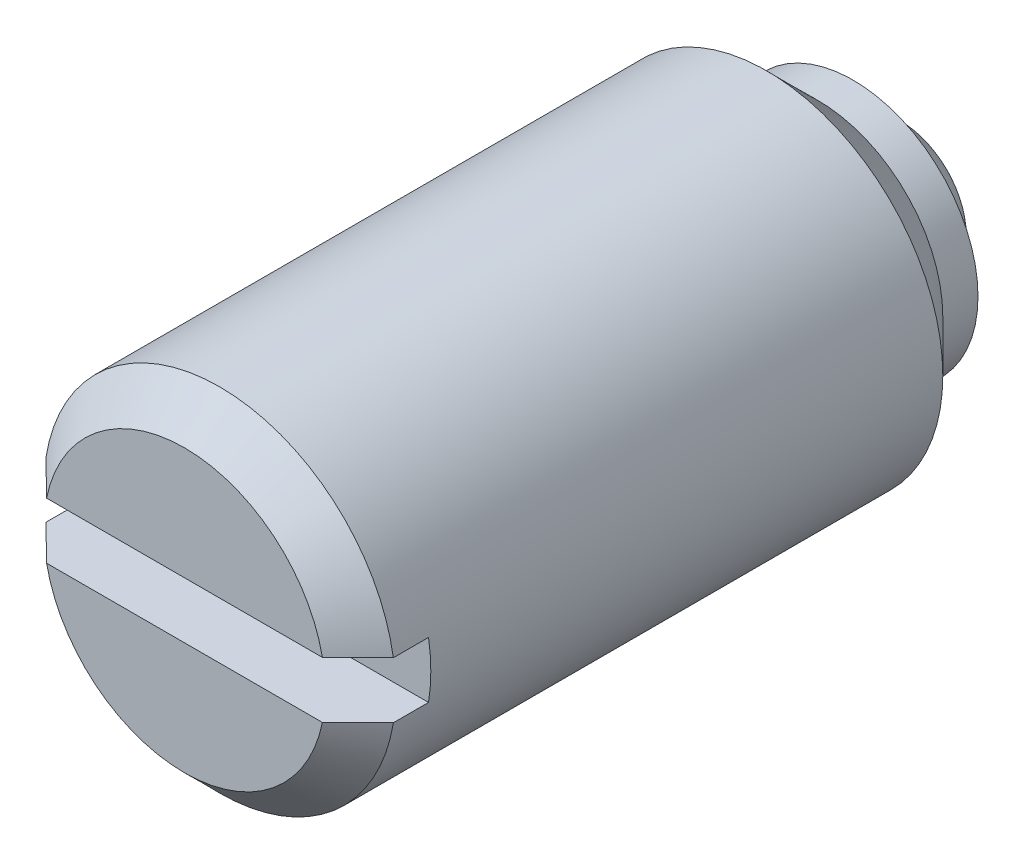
ISO-10303-21;
HEADER;
FILE_DESCRIPTION(('STEP AP214'),'2;1');
FILE_NAME('part.step','',(''),(''),'','','');
FILE_SCHEMA(('AUTOMOTIVE_DESIGN { 1 0 10303 214 1 1 1 1 }'));
ENDSEC;
DATA;
#1=APPLICATION_CONTEXT('core data for automotive mechanical design processes');
#2=APPLICATION_PROTOCOL_DEFINITION('international standard','automotive_design',2000,#1);
#3=PRODUCT_CONTEXT('',#1,'mechanical');
#4=PRODUCT('Part','Part','',(#3));
#5=PRODUCT_RELATED_PRODUCT_CATEGORY('part','',(#4));
#6=PRODUCT_DEFINITION_FORMATION('','',#4);
#7=PRODUCT_DEFINITION_CONTEXT('part definition',#1,'design');
#8=PRODUCT_DEFINITION('design','',#6,#7);
#9=PRODUCT_DEFINITION_SHAPE('','',#8);
#10=(LENGTH_UNIT() NAMED_UNIT(*) SI_UNIT(.MILLI.,.METRE.));
#11=(NAMED_UNIT(*) PLANE_ANGLE_UNIT() SI_UNIT($,.RADIAN.));
#12=(NAMED_UNIT(*) SI_UNIT($,.STERADIAN.) SOLID_ANGLE_UNIT());
#13=UNCERTAINTY_MEASURE_WITH_UNIT(LENGTH_MEASURE(1.E-05),#10,'distance_accuracy_value','');
#14=(GEOMETRIC_REPRESENTATION_CONTEXT(3) GLOBAL_UNCERTAINTY_ASSIGNED_CONTEXT((#13)) GLOBAL_UNIT_ASSIGNED_CONTEXT((#10,
#11,#12)) REPRESENTATION_CONTEXT('',''));
#15=CARTESIAN_POINT('',(0.,0.,0.));
#16=DIRECTION('',(0.,0.,1.));
#17=DIRECTION('',(1.,0.,0.));
#18=AXIS2_PLACEMENT_3D('',#15,#16,#17);
#19=CARTESIAN_POINT('',(0.,0.,1.));
#20=DIRECTION('',(0.,0.,-1.));
#21=DIRECTION('',(-1.,0.,0.));
#22=AXIS2_PLACEMENT_3D('',#19,#20,#21);
#23=CYLINDRICAL_SURFACE('',#22,5.);
#24=DIRECTION('',(0.,0.,1.));
#25=VECTOR('',#24,1.);
#26=CARTESIAN_POINT('',(4.93558507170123,-0.8,19.));
#27=LINE('',#26,#25);
#28=CARTESIAN_POINT('',(4.93558507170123,-0.8,19.));
#29=VERTEX_POINT('',#28);
#30=CARTESIAN_POINT('',(4.93558507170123,-0.8,20.));
#31=VERTEX_POINT('',#30);
#32=EDGE_CURVE('E83',#29,#31,#27,.T.);
#33=ORIENTED_EDGE('',*,*,#32,.T.);
#34=CARTESIAN_POINT('',(0.,0.,20.));
#35=DIRECTION('',(0.,0.,1.));
#36=DIRECTION('',(1.,0.,0.));
#37=AXIS2_PLACEMENT_3D('',#34,#35,#36);
#38=CIRCLE('',#37,5.);
#39=CARTESIAN_POINT('',(-4.93558507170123,-0.8,20.));
#40=VERTEX_POINT('',#39);
#41=EDGE_CURVE('E89',#31,#40,#38,.F.);
#42=ORIENTED_EDGE('',*,*,#41,.T.);
#43=DIRECTION('',(0.,0.,1.));
#44=VECTOR('',#43,1.);
#45=CARTESIAN_POINT('',(-4.93558507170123,-0.8,19.));
#46=LINE('',#45,#44);
#47=CARTESIAN_POINT('',(-4.93558507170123,-0.8,19.));
#48=VERTEX_POINT('',#47);
#49=EDGE_CURVE('E81',#48,#40,#46,.T.);
#50=ORIENTED_EDGE('',*,*,#49,.F.);
#51=CARTESIAN_POINT('',(0.,0.,19.));
#52=DIRECTION('',(0.,0.,1.));
#53=DIRECTION('',(1.,0.,0.));
#54=AXIS2_PLACEMENT_3D('',#51,#52,#53);
#55=CIRCLE('',#54,5.);
#56=CARTESIAN_POINT('',(-4.93558507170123,0.8,19.));
#57=VERTEX_POINT('',#56);
#58=EDGE_CURVE('E65',#57,#48,#55,.T.);
#59=ORIENTED_EDGE('',*,*,#58,.F.);
#60=DIRECTION('',(0.,0.,1.));
#61=VECTOR('',#60,1.);
#62=CARTESIAN_POINT('',(-4.93558507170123,0.8,19.));
#63=LINE('',#62,#61);
#64=CARTESIAN_POINT('',(-4.93558507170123,0.8,20.));
#65=VERTEX_POINT('',#64);
#66=EDGE_CURVE('E96',#57,#65,#63,.T.);
#67=ORIENTED_EDGE('',*,*,#66,.T.);
#68=CARTESIAN_POINT('',(0.,0.,20.));
#69=DIRECTION('',(0.,0.,1.));
#70=DIRECTION('',(1.,0.,0.));
#71=AXIS2_PLACEMENT_3D('',#68,#69,#70);
#72=CIRCLE('',#71,5.);
#73=CARTESIAN_POINT('',(4.93558507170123,0.8,20.));
#74=VERTEX_POINT('',#73);
#75=EDGE_CURVE('E101',#65,#74,#72,.F.);
#76=ORIENTED_EDGE('',*,*,#75,.T.);
#77=DIRECTION('',(0.,0.,1.));
#78=VECTOR('',#77,1.);
#79=CARTESIAN_POINT('',(4.93558507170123,0.8,19.));
#80=LINE('',#79,#78);
#81=CARTESIAN_POINT('',(4.93558507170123,0.8,19.));
#82=VERTEX_POINT('',#81);
#83=EDGE_CURVE('E91',#82,#74,#80,.T.);
#84=ORIENTED_EDGE('',*,*,#83,.F.);
#85=EDGE_CURVE('E77',#29,#82,#55,.T.);
#86=ORIENTED_EDGE('',*,*,#85,.F.);
#87=EDGE_LOOP('',(#33,#42,#50,#59,#67,#76,#84,#86));
#88=FACE_BOUND('',#87,.T.);
#89=CARTESIAN_POINT('',(0.,0.,4.45));
#90=DIRECTION('',(0.,0.,1.));
#91=DIRECTION('',(1.,0.,0.));
#92=AXIS2_PLACEMENT_3D('',#89,#90,#91);
#93=CIRCLE('',#92,5.);
#94=CARTESIAN_POINT('',(5.,0.,4.45));
#95=VERTEX_POINT('',#94);
#96=EDGE_CURVE('E165',#95,#95,#93,.T.);
#97=ORIENTED_EDGE('',*,*,#96,.T.);
#98=EDGE_LOOP('',(#97));
#99=FACE_BOUND('',#98,.T.);
#100=ADVANCED_FACE('F14',(#88,#99),#23,.T.);
#101=CARTESIAN_POINT('',(0.,5.,21.));
#102=DIRECTION('',(0.,0.,1.));
#103=DIRECTION('',(1.,0.,0.));
#104=AXIS2_PLACEMENT_3D('',#101,#102,#103);
#105=PLANE('',#104);
#106=DIRECTION('',(1.,0.,0.));
#107=VECTOR('',#106,1.);
#108=CARTESIAN_POINT('',(-4.93558507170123,0.8,21.));
#109=LINE('',#108,#107);
#110=CARTESIAN_POINT('',(-3.91918358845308,0.8,21.));
#111=VERTEX_POINT('',#110);
#112=CARTESIAN_POINT('',(3.91918358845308,0.8,21.));
#113=VERTEX_POINT('',#112);
#114=EDGE_CURVE('E75',#111,#113,#109,.T.);
#115=ORIENTED_EDGE('',*,*,#114,.T.);
#116=CARTESIAN_POINT('',(0.,0.,21.));
#117=DIRECTION('',(0.,0.,1.));
#118=DIRECTION('',(1.,0.,0.));
#119=AXIS2_PLACEMENT_3D('',#116,#117,#118);
#120=CIRCLE('',#119,4.);
#121=EDGE_CURVE('E9',#113,#111,#120,.T.);
#122=ORIENTED_EDGE('',*,*,#121,.T.);
#123=EDGE_LOOP('',(#115,#122));
#124=FACE_BOUND('',#123,.T.);
#125=ADVANCED_FACE('F182',(#124),#105,.T.);
#126=DIRECTION('',(1.,0.,0.));
#127=VECTOR('',#126,1.);
#128=CARTESIAN_POINT('',(-4.93558507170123,-0.8,21.));
#129=LINE('',#128,#127);
#130=CARTESIAN_POINT('',(-3.91918358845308,-0.8,21.));
#131=VERTEX_POINT('',#130);
#132=CARTESIAN_POINT('',(3.91918358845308,-0.8,21.));
#133=VERTEX_POINT('',#132);
#134=EDGE_CURVE('E152',#131,#133,#129,.T.);
#135=ORIENTED_EDGE('',*,*,#134,.F.);
#136=CARTESIAN_POINT('',(0.,0.,21.));
#137=DIRECTION('',(0.,0.,1.));
#138=DIRECTION('',(1.,0.,0.));
#139=AXIS2_PLACEMENT_3D('',#136,#137,#138);
#140=CIRCLE('',#139,4.);
#141=EDGE_CURVE('E146',#131,#133,#140,.T.);
#142=ORIENTED_EDGE('',*,*,#141,.T.);
#143=EDGE_LOOP('',(#135,#142));
#144=FACE_BOUND('',#143,.T.);
#145=ADVANCED_FACE('F132',(#144),#105,.T.);
#146=CARTESIAN_POINT('',(-4.93558507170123,0.8,19.));
#147=DIRECTION('',(0.,-1.,0.));
#148=DIRECTION('',(1.,0.,0.));
#149=AXIS2_PLACEMENT_3D('',#146,#147,#148);
#150=PLANE('',#149);
#151=ORIENTED_EDGE('',*,*,#83,.T.);
#152=CARTESIAN_POINT('',(4.93558507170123,0.8,20.));
#153=CARTESIAN_POINT('',(4.85102221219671,0.8,20.0834727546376));
#154=CARTESIAN_POINT('',(4.76643256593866,0.799999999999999,20.1669183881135));
#155=CARTESIAN_POINT('',(4.59718901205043,0.799999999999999,20.3337443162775));
#156=CARTESIAN_POINT('',(4.51253510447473,0.799999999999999,20.4171246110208));
#157=CARTESIAN_POINT('',(4.34315217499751,0.799999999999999,20.583808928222));
#158=CARTESIAN_POINT('',(4.25842315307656,0.799999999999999,20.6671129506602));
#159=CARTESIAN_POINT('',(4.08887483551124,0.799999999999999,20.8336292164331));
#160=CARTESIAN_POINT('',(4.00405553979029,0.8,20.9168414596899));
#161=CARTESIAN_POINT('',(3.91918358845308,0.8,21.));
#162=B_SPLINE_CURVE_WITH_KNOTS('',3,(#152,#153,#154,#155,#156,#157,#158,#159,#160,#161),
.UNSPECIFIED.,.F.,.F.,(4,2,2,2,4),(0.,0.356464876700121,0.712929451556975,1.06939411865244,
1.42585908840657),.UNSPECIFIED.);
#163=EDGE_CURVE('E23',#74,#113,#162,.T.);
#164=ORIENTED_EDGE('',*,*,#163,.T.);
#165=ORIENTED_EDGE('',*,*,#114,.F.);
#166=CARTESIAN_POINT('',(-3.91918358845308,0.8,21.));
#167=CARTESIAN_POINT('',(-4.00405553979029,0.8,20.9168414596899));
#168=CARTESIAN_POINT('',(-4.08887483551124,0.8,20.8336292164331));
#169=CARTESIAN_POINT('',(-4.25842315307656,0.8,20.6671129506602));
#170=CARTESIAN_POINT('',(-4.34315217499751,0.8,20.583808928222));
#171=CARTESIAN_POINT('',(-4.51253510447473,0.8,20.4171246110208));
#172=CARTESIAN_POINT('',(-4.59718901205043,0.8,20.3337443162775));
#173=CARTESIAN_POINT('',(-4.76643256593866,0.8,20.1669183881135));
#174=CARTESIAN_POINT('',(-4.85102221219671,0.8,20.0834727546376));
#175=CARTESIAN_POINT('',(-4.93558507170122,0.8,20.));
#176=B_SPLINE_CURVE_WITH_KNOTS('',3,(#166,#167,#168,#169,#170,#171,#172,#173,#174,#175),
.UNSPECIFIED.,.F.,.F.,(4,2,2,2,4),(0.,0.356464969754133,0.71292963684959,1.06939421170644,
1.42585908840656),.UNSPECIFIED.);
#177=EDGE_CURVE('E137',#111,#65,#176,.T.);
#178=ORIENTED_EDGE('',*,*,#177,.T.);
#179=ORIENTED_EDGE('',*,*,#66,.F.);
#180=DIRECTION('',(1.,0.,0.));
#181=VECTOR('',#180,1.);
#182=CARTESIAN_POINT('',(-4.93558507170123,0.8,19.));
#183=LINE('',#182,#181);
#184=EDGE_CURVE('E71',#57,#82,#183,.T.);
#185=ORIENTED_EDGE('',*,*,#184,.T.);
#186=EDGE_LOOP('',(#151,#164,#165,#178,#179,#185));
#187=FACE_BOUND('',#186,.T.);
#188=ADVANCED_FACE('F125',(#187),#150,.T.);
#189=CARTESIAN_POINT('',(-4.93558507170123,-0.8,19.));
#190=DIRECTION('',(0.,-1.,0.));
#191=DIRECTION('',(1.,0.,0.));
#192=AXIS2_PLACEMENT_3D('',#189,#190,#191);
#193=PLANE('',#192);
#194=ORIENTED_EDGE('',*,*,#49,.T.);
#195=CARTESIAN_POINT('',(-4.93558507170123,-0.8,20.));
#196=CARTESIAN_POINT('',(-4.85102221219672,-0.8,20.0834727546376));
#197=CARTESIAN_POINT('',(-4.76643256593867,-0.8,20.1669183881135));
#198=CARTESIAN_POINT('',(-4.59718901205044,-0.8,20.3337443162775));
#199=CARTESIAN_POINT('',(-4.51253510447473,-0.8,20.4171246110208));
#200=CARTESIAN_POINT('',(-4.34315217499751,-0.8,20.583808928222));
#201=CARTESIAN_POINT('',(-4.25842315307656,-0.8,20.6671129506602));
#202=CARTESIAN_POINT('',(-4.08887483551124,-0.8,20.8336292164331));
#203=CARTESIAN_POINT('',(-4.00405553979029,-0.8,20.9168414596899));
#204=CARTESIAN_POINT('',(-3.91918358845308,-0.8,21.));
#205=B_SPLINE_CURVE_WITH_KNOTS('',3,(#195,#196,#197,#198,#199,#200,#201,#202,#203,#204),
.UNSPECIFIED.,.F.,.F.,(4,2,2,2,4),(0.,0.356464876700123,0.712929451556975,1.06939411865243,
1.42585908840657),.UNSPECIFIED.);
#206=EDGE_CURVE('E112',#40,#131,#205,.T.);
#207=ORIENTED_EDGE('',*,*,#206,.T.);
#208=ORIENTED_EDGE('',*,*,#134,.T.);
#209=CARTESIAN_POINT('',(3.91918358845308,-0.8,21.));
#210=CARTESIAN_POINT('',(4.00405553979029,-0.8,20.9168414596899));
#211=CARTESIAN_POINT('',(4.08887483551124,-0.800000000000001,20.8336292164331));
#212=CARTESIAN_POINT('',(4.25842315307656,-0.800000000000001,20.6671129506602));
#213=CARTESIAN_POINT('',(4.34315217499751,-0.800000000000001,20.583808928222));
#214=CARTESIAN_POINT('',(4.51253510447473,-0.800000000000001,20.4171246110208));
#215=CARTESIAN_POINT('',(4.59718901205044,-0.800000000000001,20.3337443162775));
#216=CARTESIAN_POINT('',(4.76643256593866,-0.800000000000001,20.1669183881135));
#217=CARTESIAN_POINT('',(4.85102221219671,-0.8,20.0834727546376));
#218=CARTESIAN_POINT('',(4.93558507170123,-0.8,20.));
#219=B_SPLINE_CURVE_WITH_KNOTS('',3,(#209,#210,#211,#212,#213,#214,#215,#216,#217,#218),
.UNSPECIFIED.,.F.,.F.,(4,2,2,2,4),(0.,0.356464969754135,0.712929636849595,1.06939421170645,
1.42585908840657),.UNSPECIFIED.);
#220=EDGE_CURVE('E105',#133,#31,#219,.T.);
#221=ORIENTED_EDGE('',*,*,#220,.T.);
#222=ORIENTED_EDGE('',*,*,#32,.F.);
#223=DIRECTION('',(1.,0.,0.));
#224=VECTOR('',#223,1.);
#225=CARTESIAN_POINT('',(-4.93558507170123,-0.8,19.));
#226=LINE('',#225,#224);
#227=EDGE_CURVE('E68',#48,#29,#226,.T.);
#228=ORIENTED_EDGE('',*,*,#227,.F.);
#229=EDGE_LOOP('',(#194,#207,#208,#221,#222,#228));
#230=FACE_BOUND('',#229,.T.);
#231=ADVANCED_FACE('F80',(#230),#193,.F.);
#232=CARTESIAN_POINT('',(0.,0.,19.));
#233=DIRECTION('',(0.,0.,1.));
#234=DIRECTION('',(1.,0.,0.));
#235=AXIS2_PLACEMENT_3D('',#232,#233,#234);
#236=PLANE('',#235);
#237=ORIENTED_EDGE('',*,*,#58,.T.);
#238=ORIENTED_EDGE('',*,*,#227,.T.);
#239=ORIENTED_EDGE('',*,*,#85,.T.);
#240=ORIENTED_EDGE('',*,*,#184,.F.);
#241=EDGE_LOOP('',(#237,#238,#239,#240));
#242=FACE_BOUND('',#241,.T.);
#243=ADVANCED_FACE('F67',(#242),#236,.T.);
#244=CARTESIAN_POINT('',(0.,0.,24.0697883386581));
#245=DIRECTION('',(0.,0.,1.));
#246=DIRECTION('',(1.,0.,0.));
#247=AXIS2_PLACEMENT_3D('',#244,#245,#246);
#248=CYLINDRICAL_SURFACE('',#247,3.55);
#249=CARTESIAN_POINT('',(0.,0.,2.));
#250=DIRECTION('',(0.,0.,1.));
#251=DIRECTION('',(1.,0.,0.));
#252=AXIS2_PLACEMENT_3D('',#249,#250,#251);
#253=CIRCLE('',#252,3.55);
#254=CARTESIAN_POINT('',(3.55,0.,2.));
#255=VERTEX_POINT('',#254);
#256=EDGE_CURVE('E155',#255,#255,#253,.T.);
#257=ORIENTED_EDGE('',*,*,#256,.T.);
#258=EDGE_LOOP('',(#257));
#259=FACE_BOUND('',#258,.T.);
#260=CARTESIAN_POINT('',(0.,0.,3.));
#261=DIRECTION('',(0.,0.,1.));
#262=DIRECTION('',(1.,0.,0.));
#263=AXIS2_PLACEMENT_3D('',#260,#261,#262);
#264=CIRCLE('',#263,3.55);
#265=CARTESIAN_POINT('',(3.55,0.,3.));
#266=VERTEX_POINT('',#265);
#267=EDGE_CURVE('E162',#266,#266,#264,.T.);
#268=ORIENTED_EDGE('',*,*,#267,.F.);
#269=EDGE_LOOP('',(#268));
#270=FACE_BOUND('',#269,.T.);
#271=ADVANCED_FACE('F126',(#259,#270),#248,.T.);
#272=CARTESIAN_POINT('',(0.,0.,4.45));
#273=DIRECTION('',(0.,0.,1.));
#274=DIRECTION('',(1.,0.,0.));
#275=AXIS2_PLACEMENT_3D('',#272,#273,#274);
#276=CONICAL_SURFACE('',#275,5.,0.785398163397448);
#277=ORIENTED_EDGE('',*,*,#267,.T.);
#278=EDGE_LOOP('',(#277));
#279=FACE_BOUND('',#278,.T.);
#280=ORIENTED_EDGE('',*,*,#96,.F.);
#281=EDGE_LOOP('',(#280));
#282=FACE_BOUND('',#281,.T.);
#283=ADVANCED_FACE('F169',(#279,#282),#276,.T.);
#284=CARTESIAN_POINT('',(0.,0.,3.));
#285=DIRECTION('',(-1.,0.,0.));
#286=DIRECTION('',(0.,0.,1.));
#287=AXIS2_PLACEMENT_3D('',#284,#285,#286);
#288=SPHERICAL_SURFACE('',#287,3.);
#289=CARTESIAN_POINT('',(0.,0.,3.));
#290=DIRECTION('',(0.,0.,-1.));
#291=DIRECTION('',(-1.,0.,0.));
#292=AXIS2_PLACEMENT_3D('',#289,#290,#291);
#293=SPHERICAL_SURFACE('',#292,3.);
#294=CARTESIAN_POINT('',(0.,0.,2.));
#295=DIRECTION('',(0.,0.,-1.));
#296=DIRECTION('',(-1.,0.,0.));
#297=AXIS2_PLACEMENT_3D('',#294,#295,#296);
#298=CIRCLE('',#297,2.82842712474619);
#299=CARTESIAN_POINT('',(-2.82842712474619,0.,2.));
#300=VERTEX_POINT('',#299);
#301=EDGE_CURVE('E98',#300,#300,#298,.T.);
#302=ORIENTED_EDGE('',*,*,#301,.T.);
#303=EDGE_LOOP('',(#302));
#304=FACE_BOUND('',#303,.T.);
#305=ADVANCED_FACE('F171',(#304),#293,.T.);
#306=CARTESIAN_POINT('',(0.,2.82842712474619,2.));
#307=DIRECTION('',(0.,0.,-1.));
#308=DIRECTION('',(-1.,0.,0.));
#309=AXIS2_PLACEMENT_3D('',#306,#307,#308);
#310=PLANE('',#309);
#311=ORIENTED_EDGE('',*,*,#301,.F.);
#312=EDGE_LOOP('',(#311));
#313=FACE_BOUND('',#312,.T.);
#314=ORIENTED_EDGE('',*,*,#256,.F.);
#315=EDGE_LOOP('',(#314));
#316=FACE_BOUND('',#315,.T.);
#317=ADVANCED_FACE('F133',(#313,#316),#310,.T.);
#318=CARTESIAN_POINT('',(0.,0.,20.));
#319=DIRECTION('',(0.,0.,-1.));
#320=DIRECTION('',(-1.,0.,0.));
#321=AXIS2_PLACEMENT_3D('',#318,#319,#320);
#322=CONICAL_SURFACE('',#321,5.,0.78539816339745);
#323=ORIENTED_EDGE('',*,*,#220,.F.);
#324=ORIENTED_EDGE('',*,*,#141,.F.);
#325=ORIENTED_EDGE('',*,*,#206,.F.);
#326=ORIENTED_EDGE('',*,*,#41,.F.);
#327=EDGE_LOOP('',(#323,#324,#325,#326));
#328=FACE_BOUND('',#327,.T.);
#329=ADVANCED_FACE('F118',(#328),#322,.T.);
#330=CARTESIAN_POINT('',(0.,0.,20.));
#331=DIRECTION('',(0.,0.,-1.));
#332=DIRECTION('',(-1.,0.,0.));
#333=AXIS2_PLACEMENT_3D('',#330,#331,#332);
#334=CONICAL_SURFACE('',#333,5.,0.78539816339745);
#335=ORIENTED_EDGE('',*,*,#177,.F.);
#336=ORIENTED_EDGE('',*,*,#121,.F.);
#337=ORIENTED_EDGE('',*,*,#163,.F.);
#338=ORIENTED_EDGE('',*,*,#75,.F.);
#339=EDGE_LOOP('',(#335,#336,#337,#338));
#340=FACE_BOUND('',#339,.T.);
#341=ADVANCED_FACE('F16',(#340),#334,.T.);
#342=CLOSED_SHELL('',(#100,#125,#145,#188,#231,#243,#271,#283,#305,#317,#329,#341));
#343=MANIFOLD_SOLID_BREP('B1',#342);
#344=ADVANCED_BREP_SHAPE_REPRESENTATION('',(#18,#343),#14);
#345=SHAPE_DEFINITION_REPRESENTATION(#9,#344);
ENDSEC;
END-ISO-10303-21;
